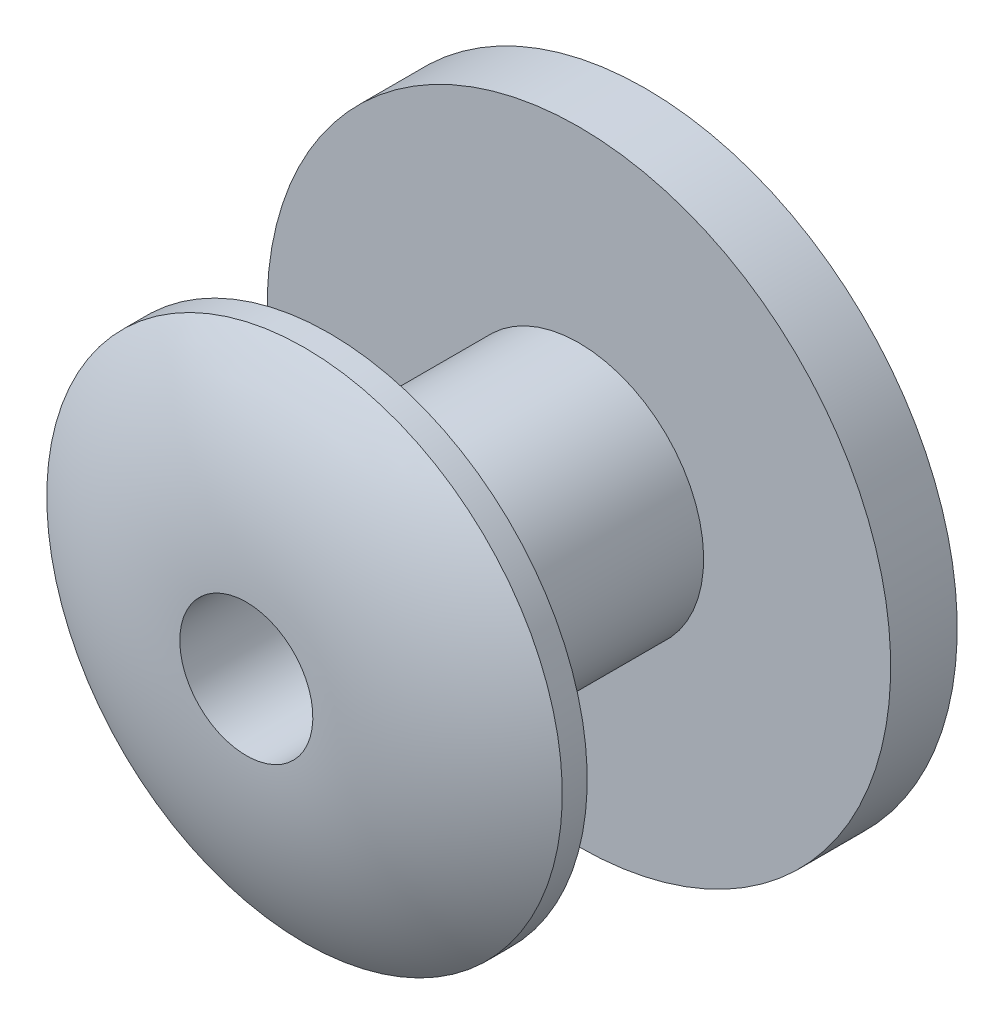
ISO-10303-21;
HEADER;
FILE_DESCRIPTION(('STEP AP214'),'2;1');
FILE_NAME('part.step','',(''),(''),'','','');
FILE_SCHEMA(('AUTOMOTIVE_DESIGN { 1 0 10303 214 1 1 1 1 }'));
ENDSEC;
DATA;
#1=APPLICATION_CONTEXT('core data for automotive mechanical design processes');
#2=APPLICATION_PROTOCOL_DEFINITION('international standard','automotive_design',2000,#1);
#3=PRODUCT_CONTEXT('',#1,'mechanical');
#4=PRODUCT('Part','Part','',(#3));
#5=PRODUCT_RELATED_PRODUCT_CATEGORY('part','',(#4));
#6=PRODUCT_DEFINITION_FORMATION('','',#4);
#7=PRODUCT_DEFINITION_CONTEXT('part definition',#1,'design');
#8=PRODUCT_DEFINITION('design','',#6,#7);
#9=PRODUCT_DEFINITION_SHAPE('','',#8);
#10=(LENGTH_UNIT() NAMED_UNIT(*) SI_UNIT(.MILLI.,.METRE.));
#11=(NAMED_UNIT(*) PLANE_ANGLE_UNIT() SI_UNIT($,.RADIAN.));
#12=(NAMED_UNIT(*) SI_UNIT($,.STERADIAN.) SOLID_ANGLE_UNIT());
#13=UNCERTAINTY_MEASURE_WITH_UNIT(LENGTH_MEASURE(1.E-05),#10,'distance_accuracy_value','');
#14=(GEOMETRIC_REPRESENTATION_CONTEXT(3) GLOBAL_UNCERTAINTY_ASSIGNED_CONTEXT((#13)) GLOBAL_UNIT_ASSIGNED_CONTEXT((#10,
#11,#12)) REPRESENTATION_CONTEXT('',''));
#15=CARTESIAN_POINT('',(0.,0.,0.));
#16=DIRECTION('',(0.,0.,1.));
#17=DIRECTION('',(1.,0.,0.));
#18=AXIS2_PLACEMENT_3D('',#15,#16,#17);
#19=CARTESIAN_POINT('',(0.,0.,0.));
#20=DIRECTION('',(0.,0.,-1.));
#21=DIRECTION('',(0.,1.,0.));
#22=AXIS2_PLACEMENT_3D('',#19,#20,#21);
#23=CYLINDRICAL_SURFACE('',#22,3.1);
#24=CARTESIAN_POINT('',(0.,0.,4.1));
#25=DIRECTION('',(0.,0.,-1.));
#26=DIRECTION('',(0.,1.,0.));
#27=AXIS2_PLACEMENT_3D('',#24,#25,#26);
#28=CIRCLE('',#27,3.1);
#29=CARTESIAN_POINT('',(0.,3.1,4.1));
#30=VERTEX_POINT('',#29);
#31=EDGE_CURVE('E10',#30,#30,#28,.T.);
#32=ORIENTED_EDGE('',*,*,#31,.T.);
#33=EDGE_LOOP('',(#32));
#34=FACE_BOUND('',#33,.T.);
#35=CARTESIAN_POINT('',(0.,0.,3.8));
#36=DIRECTION('',(0.,0.,-1.));
#37=DIRECTION('',(0.,1.,0.));
#38=AXIS2_PLACEMENT_3D('',#35,#36,#37);
#39=CIRCLE('',#38,3.1);
#40=CARTESIAN_POINT('',(0.,3.1,3.8));
#41=VERTEX_POINT('',#40);
#42=EDGE_CURVE('E58',#41,#41,#39,.T.);
#43=ORIENTED_EDGE('',*,*,#42,.F.);
#44=EDGE_LOOP('',(#43));
#45=FACE_BOUND('',#44,.T.);
#46=ADVANCED_FACE('F30',(#34,#45),#23,.T.);
#47=CARTESIAN_POINT('',(0.,0.,0.67142857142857));
#48=DIRECTION('',(0.,0.,-1.));
#49=DIRECTION('',(0.,1.,0.));
#50=AXIS2_PLACEMENT_3D('',#47,#48,#49);
#51=DEGENERATE_TOROIDAL_SURFACE('',#50,0.8,4.12857142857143,.T.);
#52=CARTESIAN_POINT('',(0.,0.,4.8));
#53=DIRECTION('',(0.,0.,-1.));
#54=DIRECTION('',(0.,1.,0.));
#55=AXIS2_PLACEMENT_3D('',#52,#53,#54);
#56=CIRCLE('',#55,0.8);
#57=CARTESIAN_POINT('',(0.,0.799999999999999,4.8));
#58=VERTEX_POINT('',#57);
#59=EDGE_CURVE('E36',#58,#58,#56,.T.);
#60=ORIENTED_EDGE('',*,*,#59,.T.);
#61=EDGE_LOOP('',(#60));
#62=FACE_BOUND('',#61,.T.);
#63=ORIENTED_EDGE('',*,*,#31,.F.);
#64=EDGE_LOOP('',(#63));
#65=FACE_BOUND('',#64,.T.);
#66=ADVANCED_FACE('F66',(#62,#65),#51,.T.);
#67=CARTESIAN_POINT('',(0.,0.,0.));
#68=DIRECTION('',(0.,0.,-1.));
#69=DIRECTION('',(0.,1.,0.));
#70=AXIS2_PLACEMENT_3D('',#67,#68,#69);
#71=CYLINDRICAL_SURFACE('',#70,0.8);
#72=CARTESIAN_POINT('',(0.,0.,0.));
#73=DIRECTION('',(0.,0.,-1.));
#74=DIRECTION('',(0.,1.,0.));
#75=AXIS2_PLACEMENT_3D('',#72,#73,#74);
#76=CIRCLE('',#75,0.8);
#77=CARTESIAN_POINT('',(0.,0.8,0.));
#78=VERTEX_POINT('',#77);
#79=EDGE_CURVE('E40',#78,#78,#76,.T.);
#80=ORIENTED_EDGE('',*,*,#79,.T.);
#81=EDGE_LOOP('',(#80));
#82=FACE_BOUND('',#81,.T.);
#83=ORIENTED_EDGE('',*,*,#59,.F.);
#84=EDGE_LOOP('',(#83));
#85=FACE_BOUND('',#84,.T.);
#86=ADVANCED_FACE('F70',(#82,#85),#71,.F.);
#87=CARTESIAN_POINT('',(0.,3.75,0.));
#88=DIRECTION('',(0.,0.,-1.));
#89=DIRECTION('',(0.,1.,0.));
#90=AXIS2_PLACEMENT_3D('',#87,#88,#89);
#91=PLANE('',#90);
#92=CARTESIAN_POINT('',(0.,0.,0.));
#93=DIRECTION('',(0.,0.,-1.));
#94=DIRECTION('',(0.,1.,0.));
#95=AXIS2_PLACEMENT_3D('',#92,#93,#94);
#96=CIRCLE('',#95,3.75);
#97=CARTESIAN_POINT('',(0.,3.75,0.));
#98=VERTEX_POINT('',#97);
#99=EDGE_CURVE('E44',#98,#98,#96,.T.);
#100=ORIENTED_EDGE('',*,*,#99,.T.);
#101=EDGE_LOOP('',(#100));
#102=FACE_BOUND('',#101,.T.);
#103=ORIENTED_EDGE('',*,*,#79,.F.);
#104=EDGE_LOOP('',(#103));
#105=FACE_BOUND('',#104,.T.);
#106=ADVANCED_FACE('F74',(#102,#105),#91,.T.);
#107=CARTESIAN_POINT('',(0.,0.,0.));
#108=DIRECTION('',(0.,0.,-1.));
#109=DIRECTION('',(0.,1.,0.));
#110=AXIS2_PLACEMENT_3D('',#107,#108,#109);
#111=CYLINDRICAL_SURFACE('',#110,3.75);
#112=CARTESIAN_POINT('',(0.,0.,0.8));
#113=DIRECTION('',(0.,0.,-1.));
#114=DIRECTION('',(0.,1.,0.));
#115=AXIS2_PLACEMENT_3D('',#112,#113,#114);
#116=CIRCLE('',#115,3.75);
#117=CARTESIAN_POINT('',(0.,3.75,0.8));
#118=VERTEX_POINT('',#117);
#119=EDGE_CURVE('E49',#118,#118,#116,.T.);
#120=ORIENTED_EDGE('',*,*,#119,.T.);
#121=EDGE_LOOP('',(#120));
#122=FACE_BOUND('',#121,.T.);
#123=ORIENTED_EDGE('',*,*,#99,.F.);
#124=EDGE_LOOP('',(#123));
#125=FACE_BOUND('',#124,.T.);
#126=ADVANCED_FACE('F81',(#122,#125),#111,.T.);
#127=CARTESIAN_POINT('',(0.,1.5,0.8));
#128=DIRECTION('',(0.,0.,1.));
#129=DIRECTION('',(0.,-1.,0.));
#130=AXIS2_PLACEMENT_3D('',#127,#128,#129);
#131=PLANE('',#130);
#132=CARTESIAN_POINT('',(0.,0.,0.8));
#133=DIRECTION('',(0.,0.,-1.));
#134=DIRECTION('',(0.,1.,0.));
#135=AXIS2_PLACEMENT_3D('',#132,#133,#134);
#136=CIRCLE('',#135,1.5);
#137=CARTESIAN_POINT('',(0.,1.5,0.8));
#138=VERTEX_POINT('',#137);
#139=EDGE_CURVE('E52',#138,#138,#136,.T.);
#140=ORIENTED_EDGE('',*,*,#139,.T.);
#141=EDGE_LOOP('',(#140));
#142=FACE_BOUND('',#141,.T.);
#143=ORIENTED_EDGE('',*,*,#119,.F.);
#144=EDGE_LOOP('',(#143));
#145=FACE_BOUND('',#144,.T.);
#146=ADVANCED_FACE('F85',(#142,#145),#131,.T.);
#147=CARTESIAN_POINT('',(0.,0.,0.));
#148=DIRECTION('',(0.,0.,-1.));
#149=DIRECTION('',(0.,1.,0.));
#150=AXIS2_PLACEMENT_3D('',#147,#148,#149);
#151=CYLINDRICAL_SURFACE('',#150,1.5);
#152=CARTESIAN_POINT('',(0.,0.,3.8));
#153=DIRECTION('',(0.,0.,-1.));
#154=DIRECTION('',(0.,1.,0.));
#155=AXIS2_PLACEMENT_3D('',#152,#153,#154);
#156=CIRCLE('',#155,1.5);
#157=CARTESIAN_POINT('',(0.,1.5,3.8));
#158=VERTEX_POINT('',#157);
#159=EDGE_CURVE('E55',#158,#158,#156,.T.);
#160=ORIENTED_EDGE('',*,*,#159,.T.);
#161=EDGE_LOOP('',(#160));
#162=FACE_BOUND('',#161,.T.);
#163=ORIENTED_EDGE('',*,*,#139,.F.);
#164=EDGE_LOOP('',(#163));
#165=FACE_BOUND('',#164,.T.);
#166=ADVANCED_FACE('F89',(#162,#165),#151,.T.);
#167=CARTESIAN_POINT('',(0.,3.1,3.8));
#168=DIRECTION('',(0.,0.,-1.));
#169=DIRECTION('',(0.,1.,0.));
#170=AXIS2_PLACEMENT_3D('',#167,#168,#169);
#171=PLANE('',#170);
#172=ORIENTED_EDGE('',*,*,#42,.T.);
#173=EDGE_LOOP('',(#172));
#174=FACE_BOUND('',#173,.T.);
#175=ORIENTED_EDGE('',*,*,#159,.F.);
#176=EDGE_LOOP('',(#175));
#177=FACE_BOUND('',#176,.T.);
#178=ADVANCED_FACE('F62',(#174,#177),#171,.T.);
#179=CLOSED_SHELL('',(#46,#66,#86,#106,#126,#146,#166,#178));
#180=MANIFOLD_SOLID_BREP('B2',#179);
#181=ADVANCED_BREP_SHAPE_REPRESENTATION('',(#18,#180),#14);
#182=SHAPE_DEFINITION_REPRESENTATION(#9,#181);
ENDSEC;
END-ISO-10303-21;
